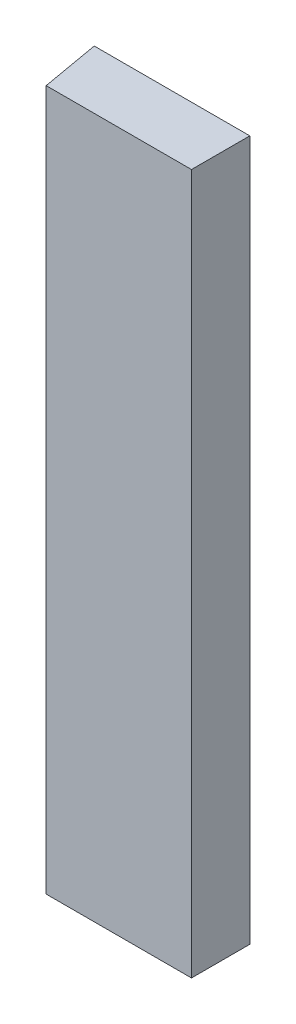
ISO-10303-21;
HEADER;
FILE_DESCRIPTION(('STEP AP214'),'2;1');
FILE_NAME('part.step','',(''),(''),'','','');
FILE_SCHEMA(('AUTOMOTIVE_DESIGN { 1 0 10303 214 1 1 1 1 }'));
ENDSEC;
DATA;
#1=APPLICATION_CONTEXT('core data for automotive mechanical design processes');
#2=APPLICATION_PROTOCOL_DEFINITION('international standard','automotive_design',2000,#1);
#3=PRODUCT_CONTEXT('',#1,'mechanical');
#4=PRODUCT('Part','Part','',(#3));
#5=PRODUCT_RELATED_PRODUCT_CATEGORY('part','',(#4));
#6=PRODUCT_DEFINITION_FORMATION('','',#4);
#7=PRODUCT_DEFINITION_CONTEXT('part definition',#1,'design');
#8=PRODUCT_DEFINITION('design','',#6,#7);
#9=PRODUCT_DEFINITION_SHAPE('','',#8);
#10=(LENGTH_UNIT() NAMED_UNIT(*) SI_UNIT(.MILLI.,.METRE.));
#11=(NAMED_UNIT(*) PLANE_ANGLE_UNIT() SI_UNIT($,.RADIAN.));
#12=(NAMED_UNIT(*) SI_UNIT($,.STERADIAN.) SOLID_ANGLE_UNIT());
#13=UNCERTAINTY_MEASURE_WITH_UNIT(LENGTH_MEASURE(1.E-05),#10,'distance_accuracy_value','');
#14=(GEOMETRIC_REPRESENTATION_CONTEXT(3) GLOBAL_UNCERTAINTY_ASSIGNED_CONTEXT((#13)) GLOBAL_UNIT_ASSIGNED_CONTEXT((#10,
#11,#12)) REPRESENTATION_CONTEXT('',''));
#15=CARTESIAN_POINT('',(0.,0.,0.));
#16=DIRECTION('',(0.,0.,1.));
#17=DIRECTION('',(1.,0.,0.));
#18=AXIS2_PLACEMENT_3D('',#15,#16,#17);
#19=CARTESIAN_POINT('',(-17.5393969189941,457.2,38.1));
#20=DIRECTION('',(0.,0.,-1.));
#21=DIRECTION('',(-1.,0.,0.));
#22=AXIS2_PLACEMENT_3D('',#19,#20,#21);
#23=PLANE('',#22);
#24=DIRECTION('',(1.,0.,0.));
#25=VECTOR('',#24,1.);
#26=CARTESIAN_POINT('',(-17.5393969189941,457.2,38.1));
#27=LINE('',#26,#25);
#28=CARTESIAN_POINT('',(-10.8213389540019,457.2,38.1));
#29=VERTEX_POINT('',#28);
#30=CARTESIAN_POINT('',(84.0606030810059,457.2,38.1));
#31=VERTEX_POINT('',#30);
#32=EDGE_CURVE('E90',#29,#31,#27,.T.);
#33=ORIENTED_EDGE('',*,*,#32,.F.);
#34=DIRECTION('',(0.,1.,0.));
#35=VECTOR('',#34,1.);
#36=CARTESIAN_POINT('',(-10.8213389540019,0.,38.1));
#37=LINE('',#36,#35);
#38=CARTESIAN_POINT('',(-10.8213389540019,0.,38.1));
#39=VERTEX_POINT('',#38);
#40=EDGE_CURVE('E87',#39,#29,#37,.T.);
#41=ORIENTED_EDGE('',*,*,#40,.F.);
#42=DIRECTION('',(1.,0.,0.));
#43=VECTOR('',#42,1.);
#44=CARTESIAN_POINT('',(-17.5393969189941,0.,38.1));
#45=LINE('',#44,#43);
#46=CARTESIAN_POINT('',(84.0606030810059,0.,38.1));
#47=VERTEX_POINT('',#46);
#48=EDGE_CURVE('E86',#39,#47,#45,.T.);
#49=ORIENTED_EDGE('',*,*,#48,.T.);
#50=DIRECTION('',(0.,-1.,0.));
#51=VECTOR('',#50,1.);
#52=CARTESIAN_POINT('',(84.0606030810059,457.2,38.1));
#53=LINE('',#52,#51);
#54=EDGE_CURVE('E11',#31,#47,#53,.T.);
#55=ORIENTED_EDGE('',*,*,#54,.F.);
#56=EDGE_LOOP('',(#33,#41,#49,#55));
#57=FACE_BOUND('',#56,.T.);
#58=ADVANCED_FACE('F32',(#57),#23,.F.);
#59=CARTESIAN_POINT('',(84.0606030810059,457.2,0.));
#60=DIRECTION('',(-1.,0.,0.));
#61=DIRECTION('',(0.,0.,1.));
#62=AXIS2_PLACEMENT_3D('',#59,#60,#61);
#63=PLANE('',#62);
#64=DIRECTION('',(0.,0.,-1.));
#65=VECTOR('',#64,1.);
#66=CARTESIAN_POINT('',(84.0606030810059,0.,0.));
#67=LINE('',#66,#65);
#68=CARTESIAN_POINT('',(84.0606030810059,0.,0.));
#69=VERTEX_POINT('',#68);
#70=EDGE_CURVE('E60',#47,#69,#67,.T.);
#71=ORIENTED_EDGE('',*,*,#70,.T.);
#72=DIRECTION('',(0.,-1.,0.));
#73=VECTOR('',#72,1.);
#74=CARTESIAN_POINT('',(84.0606030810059,457.2,0.));
#75=LINE('',#74,#73);
#76=CARTESIAN_POINT('',(84.0606030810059,457.2,0.));
#77=VERTEX_POINT('',#76);
#78=EDGE_CURVE('E40',#77,#69,#75,.T.);
#79=ORIENTED_EDGE('',*,*,#78,.F.);
#80=DIRECTION('',(0.,0.,-1.));
#81=VECTOR('',#80,1.);
#82=CARTESIAN_POINT('',(84.0606030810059,457.2,0.));
#83=LINE('',#82,#81);
#84=EDGE_CURVE('E48',#31,#77,#83,.T.);
#85=ORIENTED_EDGE('',*,*,#84,.F.);
#86=ORIENTED_EDGE('',*,*,#54,.T.);
#87=EDGE_LOOP('',(#71,#79,#85,#86));
#88=FACE_BOUND('',#87,.T.);
#89=ADVANCED_FACE('F105',(#88),#63,.F.);
#90=CARTESIAN_POINT('',(-17.5393969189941,457.2,0.));
#91=DIRECTION('',(0.,0.,1.));
#92=DIRECTION('',(1.,0.,0.));
#93=AXIS2_PLACEMENT_3D('',#90,#91,#92);
#94=PLANE('',#93);
#95=DIRECTION('',(-1.,0.,0.));
#96=VECTOR('',#95,1.);
#97=CARTESIAN_POINT('',(-17.5393969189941,0.,0.));
#98=LINE('',#97,#96);
#99=CARTESIAN_POINT('',(-17.5393969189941,0.,0.));
#100=VERTEX_POINT('',#99);
#101=EDGE_CURVE('E85',#69,#100,#98,.T.);
#102=ORIENTED_EDGE('',*,*,#101,.T.);
#103=DIRECTION('',(0.,-1.,0.));
#104=VECTOR('',#103,1.);
#105=CARTESIAN_POINT('',(-17.5393969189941,457.2,0.));
#106=LINE('',#105,#104);
#107=CARTESIAN_POINT('',(-17.5393969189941,457.2,0.));
#108=VERTEX_POINT('',#107);
#109=EDGE_CURVE('E67',#108,#100,#106,.T.);
#110=ORIENTED_EDGE('',*,*,#109,.F.);
#111=DIRECTION('',(-1.,0.,0.));
#112=VECTOR('',#111,1.);
#113=CARTESIAN_POINT('',(-17.5393969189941,457.2,0.));
#114=LINE('',#113,#112);
#115=EDGE_CURVE('E79',#77,#108,#114,.T.);
#116=ORIENTED_EDGE('',*,*,#115,.F.);
#117=ORIENTED_EDGE('',*,*,#78,.T.);
#118=EDGE_LOOP('',(#102,#110,#116,#117));
#119=FACE_BOUND('',#118,.T.);
#120=ADVANCED_FACE('F89',(#119),#94,.F.);
#121=CARTESIAN_POINT('',(0.,457.2,0.));
#122=DIRECTION('',(0.,1.,0.));
#123=DIRECTION('',(0.,0.,1.));
#124=AXIS2_PLACEMENT_3D('',#121,#122,#123);
#125=PLANE('',#124);
#126=DIRECTION('',(-0.173648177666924,0.,-0.984807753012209));
#127=VECTOR('',#126,1.);
#128=CARTESIAN_POINT('',(-17.5393969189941,457.2,0.));
#129=LINE('',#128,#127);
#130=EDGE_CURVE('E75',#29,#108,#129,.T.);
#131=ORIENTED_EDGE('',*,*,#130,.F.);
#132=ORIENTED_EDGE('',*,*,#32,.T.);
#133=ORIENTED_EDGE('',*,*,#84,.T.);
#134=ORIENTED_EDGE('',*,*,#115,.T.);
#135=EDGE_LOOP('',(#131,#132,#133,#134));
#136=FACE_BOUND('',#135,.T.);
#137=ADVANCED_FACE('F103',(#136),#125,.T.);
#138=CARTESIAN_POINT('',(0.,0.,0.));
#139=DIRECTION('',(0.,1.,0.));
#140=DIRECTION('',(0.,0.,1.));
#141=AXIS2_PLACEMENT_3D('',#138,#139,#140);
#142=PLANE('',#141);
#143=ORIENTED_EDGE('',*,*,#48,.F.);
#144=DIRECTION('',(-0.173648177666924,0.,-0.984807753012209));
#145=VECTOR('',#144,1.);
#146=CARTESIAN_POINT('',(-17.5393969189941,0.,0.));
#147=LINE('',#146,#145);
#148=EDGE_CURVE('E71',#39,#100,#147,.T.);
#149=ORIENTED_EDGE('',*,*,#148,.T.);
#150=ORIENTED_EDGE('',*,*,#101,.F.);
#151=ORIENTED_EDGE('',*,*,#70,.F.);
#152=EDGE_LOOP('',(#143,#149,#150,#151));
#153=FACE_BOUND('',#152,.T.);
#154=ADVANCED_FACE('F84',(#153),#142,.F.);
#155=CARTESIAN_POINT('',(-17.5393969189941,0.,0.));
#156=DIRECTION('',(0.984807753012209,0.,-0.173648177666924));
#157=DIRECTION('',(-0.173648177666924,0.,-0.984807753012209));
#158=AXIS2_PLACEMENT_3D('',#155,#156,#157);
#159=PLANE('',#158);
#160=ORIENTED_EDGE('',*,*,#130,.T.);
#161=ORIENTED_EDGE('',*,*,#109,.T.);
#162=ORIENTED_EDGE('',*,*,#148,.F.);
#163=ORIENTED_EDGE('',*,*,#40,.T.);
#164=EDGE_LOOP('',(#160,#161,#162,#163));
#165=FACE_BOUND('',#164,.T.);
#166=ADVANCED_FACE('F69',(#165),#159,.F.);
#167=CLOSED_SHELL('',(#58,#89,#120,#137,#154,#166));
#168=MANIFOLD_SOLID_BREP('B2',#167);
#169=ADVANCED_BREP_SHAPE_REPRESENTATION('',(#18,#168),#14);
#170=SHAPE_DEFINITION_REPRESENTATION(#9,#169);
ENDSEC;
END-ISO-10303-21;
